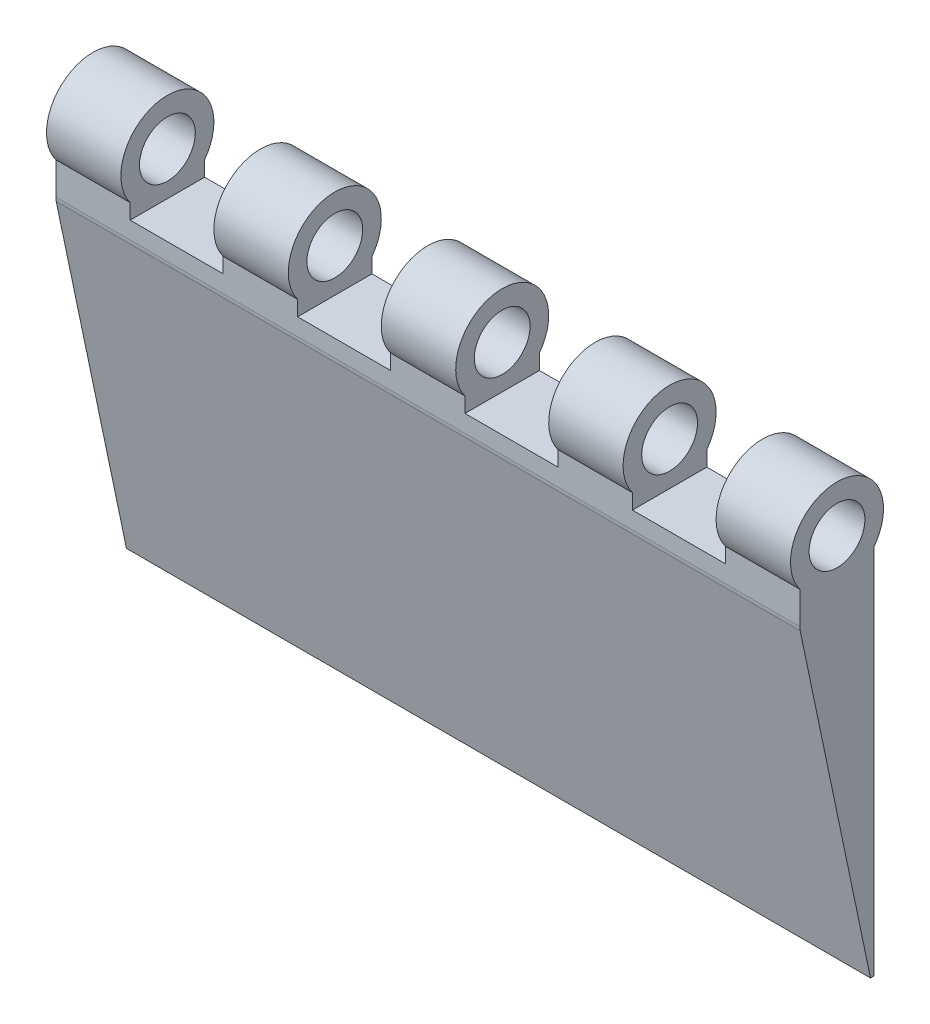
ISO-10303-21;
HEADER;
FILE_DESCRIPTION(('STEP AP214'),'2;1');
FILE_NAME('part.step','',(''),(''),'','','');
FILE_SCHEMA(('AUTOMOTIVE_DESIGN { 1 0 10303 214 1 1 1 1 }'));
ENDSEC;
DATA;
#1=APPLICATION_CONTEXT('core data for automotive mechanical design processes');
#2=APPLICATION_PROTOCOL_DEFINITION('international standard','automotive_design',2000,#1);
#3=PRODUCT_CONTEXT('',#1,'mechanical');
#4=PRODUCT('Part','Part','',(#3));
#5=PRODUCT_RELATED_PRODUCT_CATEGORY('part','',(#4));
#6=PRODUCT_DEFINITION_FORMATION('','',#4);
#7=PRODUCT_DEFINITION_CONTEXT('part definition',#1,'design');
#8=PRODUCT_DEFINITION('design','',#6,#7);
#9=PRODUCT_DEFINITION_SHAPE('','',#8);
#10=(LENGTH_UNIT() NAMED_UNIT(*) SI_UNIT(.MILLI.,.METRE.));
#11=(NAMED_UNIT(*) PLANE_ANGLE_UNIT() SI_UNIT($,.RADIAN.));
#12=(NAMED_UNIT(*) SI_UNIT($,.STERADIAN.) SOLID_ANGLE_UNIT());
#13=UNCERTAINTY_MEASURE_WITH_UNIT(LENGTH_MEASURE(1.E-05),#10,'distance_accuracy_value','');
#14=(GEOMETRIC_REPRESENTATION_CONTEXT(3) GLOBAL_UNCERTAINTY_ASSIGNED_CONTEXT((#13)) GLOBAL_UNIT_ASSIGNED_CONTEXT((#10,
#11,#12)) REPRESENTATION_CONTEXT('',''));
#15=CARTESIAN_POINT('',(0.,0.,0.));
#16=DIRECTION('',(0.,0.,1.));
#17=DIRECTION('',(1.,0.,0.));
#18=AXIS2_PLACEMENT_3D('',#15,#16,#17);
#19=CARTESIAN_POINT('',(47.0710678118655,11.5,0.));
#20=DIRECTION('',(-1.,0.,0.));
#21=DIRECTION('',(0.,0.,1.));
#22=AXIS2_PLACEMENT_3D('',#19,#20,#21);
#23=CYLINDRICAL_SURFACE('',#22,2.5);
#24=CARTESIAN_POINT('',(36.,11.5,0.));
#25=DIRECTION('',(1.,0.,0.));
#26=DIRECTION('',(0.,1.,0.));
#27=AXIS2_PLACEMENT_3D('',#24,#25,#26);
#28=CIRCLE('',#27,2.5);
#29=CARTESIAN_POINT('',(36.,10.,2.));
#30=VERTEX_POINT('',#29);
#31=CARTESIAN_POINT('',(36.,10.,-2.));
#32=VERTEX_POINT('',#31);
#33=EDGE_CURVE('E295',#30,#32,#28,.F.);
#34=ORIENTED_EDGE('',*,*,#33,.F.);
#35=DIRECTION('',(-1.,0.,0.));
#36=VECTOR('',#35,1.);
#37=CARTESIAN_POINT('',(40.,10.,2.));
#38=LINE('',#37,#36);
#39=CARTESIAN_POINT('',(40.,10.,2.));
#40=VERTEX_POINT('',#39);
#41=EDGE_CURVE('E237',#40,#30,#38,.T.);
#42=ORIENTED_EDGE('',*,*,#41,.F.);
#43=CARTESIAN_POINT('',(40.,11.5,0.));
#44=DIRECTION('',(1.,0.,0.));
#45=DIRECTION('',(0.,0.,-1.));
#46=AXIS2_PLACEMENT_3D('',#43,#44,#45);
#47=CIRCLE('',#46,2.5);
#48=CARTESIAN_POINT('',(40.,10.,-2.));
#49=VERTEX_POINT('',#48);
#50=EDGE_CURVE('E359',#40,#49,#47,.F.);
#51=ORIENTED_EDGE('',*,*,#50,.T.);
#52=DIRECTION('',(-1.,0.,0.));
#53=VECTOR('',#52,1.);
#54=CARTESIAN_POINT('',(40.,10.,-2.));
#55=LINE('',#54,#53);
#56=EDGE_CURVE('E243',#49,#32,#55,.T.);
#57=ORIENTED_EDGE('',*,*,#56,.T.);
#58=EDGE_LOOP('',(#34,#42,#51,#57));
#59=FACE_BOUND('',#58,.T.);
#60=ADVANCED_FACE('F39',(#59),#23,.T.);
#61=CARTESIAN_POINT('',(22.,11.5,0.));
#62=DIRECTION('',(-1.,0.,0.));
#63=DIRECTION('',(0.,-1.,0.));
#64=AXIS2_PLACEMENT_3D('',#61,#62,#63);
#65=CIRCLE('',#64,2.5);
#66=CARTESIAN_POINT('',(22.,10.,-2.));
#67=VERTEX_POINT('',#66);
#68=CARTESIAN_POINT('',(22.,10.,2.));
#69=VERTEX_POINT('',#68);
#70=EDGE_CURVE('E283',#67,#69,#65,.F.);
#71=ORIENTED_EDGE('',*,*,#70,.F.);
#72=CARTESIAN_POINT('',(18.,10.,-2.));
#73=VERTEX_POINT('',#72);
#74=EDGE_CURVE('E320',#67,#73,#55,.T.);
#75=ORIENTED_EDGE('',*,*,#74,.T.);
#76=CARTESIAN_POINT('',(18.,11.5,0.));
#77=DIRECTION('',(1.,0.,0.));
#78=DIRECTION('',(0.,1.,0.));
#79=AXIS2_PLACEMENT_3D('',#76,#77,#78);
#80=CIRCLE('',#79,2.5);
#81=CARTESIAN_POINT('',(18.,10.,2.));
#82=VERTEX_POINT('',#81);
#83=EDGE_CURVE('E265',#82,#73,#80,.F.);
#84=ORIENTED_EDGE('',*,*,#83,.F.);
#85=EDGE_CURVE('E329',#69,#82,#38,.T.);
#86=ORIENTED_EDGE('',*,*,#85,.F.);
#87=EDGE_LOOP('',(#71,#75,#84,#86));
#88=FACE_BOUND('',#87,.T.);
#89=ADVANCED_FACE('F388',(#88),#23,.T.);
#90=CARTESIAN_POINT('',(13.,11.5,0.));
#91=DIRECTION('',(-1.,0.,0.));
#92=DIRECTION('',(0.,-1.,0.));
#93=AXIS2_PLACEMENT_3D('',#90,#91,#92);
#94=CIRCLE('',#93,2.5);
#95=CARTESIAN_POINT('',(13.,10.,-2.));
#96=VERTEX_POINT('',#95);
#97=CARTESIAN_POINT('',(13.,10.,2.));
#98=VERTEX_POINT('',#97);
#99=EDGE_CURVE('E271',#96,#98,#94,.F.);
#100=ORIENTED_EDGE('',*,*,#99,.F.);
#101=CARTESIAN_POINT('',(9.,10.,-2.));
#102=VERTEX_POINT('',#101);
#103=EDGE_CURVE('E323',#96,#102,#55,.T.);
#104=ORIENTED_EDGE('',*,*,#103,.T.);
#105=CARTESIAN_POINT('',(9.,11.5,0.));
#106=DIRECTION('',(1.,0.,0.));
#107=DIRECTION('',(0.,1.,0.));
#108=AXIS2_PLACEMENT_3D('',#105,#106,#107);
#109=CIRCLE('',#108,2.5);
#110=CARTESIAN_POINT('',(9.,10.,2.));
#111=VERTEX_POINT('',#110);
#112=EDGE_CURVE('E253',#111,#102,#109,.F.);
#113=ORIENTED_EDGE('',*,*,#112,.F.);
#114=EDGE_CURVE('E332',#98,#111,#38,.T.);
#115=ORIENTED_EDGE('',*,*,#114,.F.);
#116=EDGE_LOOP('',(#100,#104,#113,#115));
#117=FACE_BOUND('',#116,.T.);
#118=ADVANCED_FACE('F393',(#117),#23,.T.);
#119=CARTESIAN_POINT('',(4.,11.5,0.));
#120=DIRECTION('',(-1.,0.,0.));
#121=DIRECTION('',(0.,-1.,0.));
#122=AXIS2_PLACEMENT_3D('',#119,#120,#121);
#123=CIRCLE('',#122,2.5);
#124=CARTESIAN_POINT('',(4.,10.,-2.));
#125=VERTEX_POINT('',#124);
#126=CARTESIAN_POINT('',(4.,10.,2.));
#127=VERTEX_POINT('',#126);
#128=EDGE_CURVE('E259',#125,#127,#123,.F.);
#129=ORIENTED_EDGE('',*,*,#128,.F.);
#130=CARTESIAN_POINT('',(0.,10.,-2.));
#131=VERTEX_POINT('',#130);
#132=EDGE_CURVE('E241',#125,#131,#55,.T.);
#133=ORIENTED_EDGE('',*,*,#132,.T.);
#134=CARTESIAN_POINT('',(0.,11.5,0.));
#135=DIRECTION('',(-1.,0.,0.));
#136=DIRECTION('',(0.,0.,1.));
#137=AXIS2_PLACEMENT_3D('',#134,#135,#136);
#138=CIRCLE('',#137,2.5);
#139=CARTESIAN_POINT('',(0.,10.,2.));
#140=VERTEX_POINT('',#139);
#141=EDGE_CURVE('E343',#140,#131,#138,.T.);
#142=ORIENTED_EDGE('',*,*,#141,.F.);
#143=EDGE_CURVE('E220',#127,#140,#38,.T.);
#144=ORIENTED_EDGE('',*,*,#143,.F.);
#145=EDGE_LOOP('',(#129,#133,#142,#144));
#146=FACE_BOUND('',#145,.T.);
#147=ADVANCED_FACE('F344',(#146),#23,.T.);
#148=CARTESIAN_POINT('',(47.0710678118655,11.5,0.));
#149=DIRECTION('',(-1.,0.,0.));
#150=DIRECTION('',(0.,0.,1.));
#151=AXIS2_PLACEMENT_3D('',#148,#149,#150);
#152=CYLINDRICAL_SURFACE('',#151,1.5);
#153=CARTESIAN_POINT('',(36.,11.5,0.));
#154=DIRECTION('',(1.,0.,0.));
#155=DIRECTION('',(0.,1.,0.));
#156=AXIS2_PLACEMENT_3D('',#153,#154,#155);
#157=CIRCLE('',#156,1.5);
#158=CARTESIAN_POINT('',(36.,13.,0.));
#159=VERTEX_POINT('',#158);
#160=EDGE_CURVE('E291',#159,#159,#157,.F.);
#161=ORIENTED_EDGE('',*,*,#160,.T.);
#162=EDGE_LOOP('',(#161));
#163=FACE_BOUND('',#162,.T.);
#164=CARTESIAN_POINT('',(40.,11.5,0.));
#165=DIRECTION('',(1.,0.,0.));
#166=DIRECTION('',(0.,0.,-1.));
#167=AXIS2_PLACEMENT_3D('',#164,#165,#166);
#168=CIRCLE('',#167,1.5);
#169=CARTESIAN_POINT('',(40.,11.5,-1.5));
#170=VERTEX_POINT('',#169);
#171=EDGE_CURVE('E231',#170,#170,#168,.F.);
#172=ORIENTED_EDGE('',*,*,#171,.F.);
#173=EDGE_LOOP('',(#172));
#174=FACE_BOUND('',#173,.T.);
#175=ADVANCED_FACE('F408',(#163,#174),#152,.F.);
#176=CARTESIAN_POINT('',(4.,11.5,0.));
#177=DIRECTION('',(-1.,0.,0.));
#178=DIRECTION('',(0.,-1.,0.));
#179=AXIS2_PLACEMENT_3D('',#176,#177,#178);
#180=CIRCLE('',#179,1.5);
#181=CARTESIAN_POINT('',(4.,10.,0.));
#182=VERTEX_POINT('',#181);
#183=EDGE_CURVE('E255',#182,#182,#180,.F.);
#184=ORIENTED_EDGE('',*,*,#183,.T.);
#185=EDGE_LOOP('',(#184));
#186=FACE_BOUND('',#185,.T.);
#187=CARTESIAN_POINT('',(0.,11.5,0.));
#188=DIRECTION('',(-1.,0.,0.));
#189=DIRECTION('',(0.,0.,1.));
#190=AXIS2_PLACEMENT_3D('',#187,#188,#189);
#191=CIRCLE('',#190,1.5);
#192=CARTESIAN_POINT('',(0.,11.5,1.5));
#193=VERTEX_POINT('',#192);
#194=EDGE_CURVE('E348',#193,#193,#191,.T.);
#195=ORIENTED_EDGE('',*,*,#194,.T.);
#196=EDGE_LOOP('',(#195));
#197=FACE_BOUND('',#196,.T.);
#198=ADVANCED_FACE('F413',(#186,#197),#152,.F.);
#199=CARTESIAN_POINT('',(40.,10.,-2.));
#200=DIRECTION('',(0.,0.,1.));
#201=DIRECTION('',(0.,-1.,0.));
#202=AXIS2_PLACEMENT_3D('',#199,#200,#201);
#203=PLANE('',#202);
#204=DIRECTION('',(1.,0.,0.));
#205=VECTOR('',#204,1.);
#206=CARTESIAN_POINT('',(40.,9.18500534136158,-2.));
#207=LINE('',#206,#205);
#208=CARTESIAN_POINT('',(31.,9.18500534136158,-2.));
#209=VERTEX_POINT('',#208);
#210=CARTESIAN_POINT('',(36.,9.18500534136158,-2.));
#211=VERTEX_POINT('',#210);
#212=EDGE_CURVE('E362',#209,#211,#207,.T.);
#213=ORIENTED_EDGE('',*,*,#212,.T.);
#214=DIRECTION('',(0.,1.,0.));
#215=VECTOR('',#214,1.);
#216=CARTESIAN_POINT('',(36.,10.,-2.));
#217=LINE('',#216,#215);
#218=EDGE_CURVE('E375',#211,#32,#217,.T.);
#219=ORIENTED_EDGE('',*,*,#218,.T.);
#220=ORIENTED_EDGE('',*,*,#56,.F.);
#221=DIRECTION('',(0.,1.,0.));
#222=VECTOR('',#221,1.);
#223=CARTESIAN_POINT('',(40.,10.,-2.));
#224=LINE('',#223,#222);
#225=CARTESIAN_POINT('',(40.,-10.,-2.));
#226=VERTEX_POINT('',#225);
#227=EDGE_CURVE('E222',#226,#49,#224,.T.);
#228=ORIENTED_EDGE('',*,*,#227,.F.);
#229=DIRECTION('',(-1.,0.,0.));
#230=VECTOR('',#229,1.);
#231=CARTESIAN_POINT('',(40.,-10.,-2.));
#232=LINE('',#231,#230);
#233=CARTESIAN_POINT('',(0.,-10.,-2.));
#234=VERTEX_POINT('',#233);
#235=EDGE_CURVE('E213',#226,#234,#232,.T.);
#236=ORIENTED_EDGE('',*,*,#235,.T.);
#237=DIRECTION('',(0.,1.,0.));
#238=VECTOR('',#237,1.);
#239=CARTESIAN_POINT('',(0.,10.,-2.));
#240=LINE('',#239,#238);
#241=EDGE_CURVE('E226',#234,#131,#240,.T.);
#242=ORIENTED_EDGE('',*,*,#241,.T.);
#243=ORIENTED_EDGE('',*,*,#132,.F.);
#244=DIRECTION('',(0.,-1.,0.));
#245=VECTOR('',#244,1.);
#246=CARTESIAN_POINT('',(4.,10.,-2.));
#247=LINE('',#246,#245);
#248=CARTESIAN_POINT('',(4.,9.18500534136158,-2.));
#249=VERTEX_POINT('',#248);
#250=EDGE_CURVE('E266',#125,#249,#247,.T.);
#251=ORIENTED_EDGE('',*,*,#250,.T.);
#252=DIRECTION('',(1.,0.,0.));
#253=VECTOR('',#252,1.);
#254=CARTESIAN_POINT('',(40.,9.18500534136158,-2.));
#255=LINE('',#254,#253);
#256=CARTESIAN_POINT('',(9.,9.18500534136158,-2.));
#257=VERTEX_POINT('',#256);
#258=EDGE_CURVE('E432',#249,#257,#255,.T.);
#259=ORIENTED_EDGE('',*,*,#258,.T.);
#260=DIRECTION('',(0.,1.,0.));
#261=VECTOR('',#260,1.);
#262=CARTESIAN_POINT('',(9.,10.,-2.));
#263=LINE('',#262,#261);
#264=EDGE_CURVE('E260',#257,#102,#263,.T.);
#265=ORIENTED_EDGE('',*,*,#264,.T.);
#266=ORIENTED_EDGE('',*,*,#103,.F.);
#267=DIRECTION('',(0.,-1.,0.));
#268=VECTOR('',#267,1.);
#269=CARTESIAN_POINT('',(13.,10.,-2.));
#270=LINE('',#269,#268);
#271=CARTESIAN_POINT('',(13.,9.18500534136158,-2.));
#272=VERTEX_POINT('',#271);
#273=EDGE_CURVE('E278',#96,#272,#270,.T.);
#274=ORIENTED_EDGE('',*,*,#273,.T.);
#275=DIRECTION('',(1.,0.,0.));
#276=VECTOR('',#275,1.);
#277=CARTESIAN_POINT('',(40.,9.18500534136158,-2.));
#278=LINE('',#277,#276);
#279=CARTESIAN_POINT('',(18.,9.18500534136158,-2.));
#280=VERTEX_POINT('',#279);
#281=EDGE_CURVE('E498',#272,#280,#278,.T.);
#282=ORIENTED_EDGE('',*,*,#281,.T.);
#283=DIRECTION('',(0.,1.,0.));
#284=VECTOR('',#283,1.);
#285=CARTESIAN_POINT('',(18.,10.,-2.));
#286=LINE('',#285,#284);
#287=EDGE_CURVE('E272',#280,#73,#286,.T.);
#288=ORIENTED_EDGE('',*,*,#287,.T.);
#289=ORIENTED_EDGE('',*,*,#74,.F.);
#290=DIRECTION('',(0.,-1.,0.));
#291=VECTOR('',#290,1.);
#292=CARTESIAN_POINT('',(22.,10.,-2.));
#293=LINE('',#292,#291);
#294=CARTESIAN_POINT('',(22.,9.18500534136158,-2.));
#295=VERTEX_POINT('',#294);
#296=EDGE_CURVE('E290',#67,#295,#293,.T.);
#297=ORIENTED_EDGE('',*,*,#296,.T.);
#298=DIRECTION('',(1.,0.,0.));
#299=VECTOR('',#298,1.);
#300=CARTESIAN_POINT('',(40.,9.18500534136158,-2.));
#301=LINE('',#300,#299);
#302=CARTESIAN_POINT('',(27.,9.18500534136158,-2.));
#303=VERTEX_POINT('',#302);
#304=EDGE_CURVE('E501',#295,#303,#301,.T.);
#305=ORIENTED_EDGE('',*,*,#304,.T.);
#306=DIRECTION('',(0.,1.,0.));
#307=VECTOR('',#306,1.);
#308=CARTESIAN_POINT('',(27.,10.,-2.));
#309=LINE('',#308,#307);
#310=CARTESIAN_POINT('',(27.,10.,-2.));
#311=VERTEX_POINT('',#310);
#312=EDGE_CURVE('E284',#303,#311,#309,.T.);
#313=ORIENTED_EDGE('',*,*,#312,.T.);
#314=CARTESIAN_POINT('',(31.,10.,-2.));
#315=VERTEX_POINT('',#314);
#316=EDGE_CURVE('E248',#315,#311,#55,.T.);
#317=ORIENTED_EDGE('',*,*,#316,.F.);
#318=DIRECTION('',(0.,-1.,0.));
#319=VECTOR('',#318,1.);
#320=CARTESIAN_POINT('',(31.,10.,-2.));
#321=LINE('',#320,#319);
#322=EDGE_CURVE('E296',#315,#209,#321,.T.);
#323=ORIENTED_EDGE('',*,*,#322,.T.);
#324=EDGE_LOOP('',(#213,#219,#220,#228,#236,#242,#243,#251,#259,#265,#266,#274,#282,#288,#289,
#297,#305,#313,#317,#323));
#325=FACE_BOUND('',#324,.T.);
#326=ADVANCED_FACE('F374',(#325),#203,.F.);
#327=CARTESIAN_POINT('',(40.,10.,2.));
#328=DIRECTION('',(0.,0.,-1.));
#329=DIRECTION('',(0.,1.,0.));
#330=AXIS2_PLACEMENT_3D('',#327,#328,#329);
#331=PLANE('',#330);
#332=DIRECTION('',(0.,-1.,0.));
#333=VECTOR('',#332,1.);
#334=CARTESIAN_POINT('',(0.,10.,2.));
#335=LINE('',#334,#333);
#336=CARTESIAN_POINT('',(0.,8.2567908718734,2.));
#337=VERTEX_POINT('',#336);
#338=EDGE_CURVE('E230',#140,#337,#335,.T.);
#339=ORIENTED_EDGE('',*,*,#338,.T.);
#340=DIRECTION('',(-1.,0.,0.));
#341=VECTOR('',#340,1.);
#342=CARTESIAN_POINT('',(40.,8.2567908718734,2.));
#343=LINE('',#342,#341);
#344=CARTESIAN_POINT('',(40.,8.2567908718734,2.));
#345=VERTEX_POINT('',#344);
#346=EDGE_CURVE('E48',#337,#345,#343,.F.);
#347=ORIENTED_EDGE('',*,*,#346,.T.);
#348=DIRECTION('',(0.,-1.,0.));
#349=VECTOR('',#348,1.);
#350=CARTESIAN_POINT('',(40.,10.,2.));
#351=LINE('',#350,#349);
#352=EDGE_CURVE('E216',#40,#345,#351,.T.);
#353=ORIENTED_EDGE('',*,*,#352,.F.);
#354=ORIENTED_EDGE('',*,*,#41,.T.);
#355=DIRECTION('',(0.,-1.,0.));
#356=VECTOR('',#355,1.);
#357=CARTESIAN_POINT('',(36.,10.,2.));
#358=LINE('',#357,#356);
#359=CARTESIAN_POINT('',(36.,9.18500534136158,2.));
#360=VERTEX_POINT('',#359);
#361=EDGE_CURVE('E379',#30,#360,#358,.T.);
#362=ORIENTED_EDGE('',*,*,#361,.T.);
#363=DIRECTION('',(-1.,0.,0.));
#364=VECTOR('',#363,1.);
#365=CARTESIAN_POINT('',(40.,9.18500534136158,2.));
#366=LINE('',#365,#364);
#367=CARTESIAN_POINT('',(31.,9.18500534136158,2.));
#368=VERTEX_POINT('',#367);
#369=EDGE_CURVE('E308',#360,#368,#366,.T.);
#370=ORIENTED_EDGE('',*,*,#369,.T.);
#371=DIRECTION('',(0.,1.,0.));
#372=VECTOR('',#371,1.);
#373=CARTESIAN_POINT('',(31.,10.,2.));
#374=LINE('',#373,#372);
#375=CARTESIAN_POINT('',(31.,10.,2.));
#376=VERTEX_POINT('',#375);
#377=EDGE_CURVE('E483',#368,#376,#374,.T.);
#378=ORIENTED_EDGE('',*,*,#377,.T.);
#379=CARTESIAN_POINT('',(27.,10.,2.));
#380=VERTEX_POINT('',#379);
#381=EDGE_CURVE('E242',#376,#380,#38,.T.);
#382=ORIENTED_EDGE('',*,*,#381,.T.);
#383=DIRECTION('',(0.,-1.,0.));
#384=VECTOR('',#383,1.);
#385=CARTESIAN_POINT('',(27.,10.,2.));
#386=LINE('',#385,#384);
#387=CARTESIAN_POINT('',(27.,9.18500534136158,2.));
#388=VERTEX_POINT('',#387);
#389=EDGE_CURVE('E465',#380,#388,#386,.T.);
#390=ORIENTED_EDGE('',*,*,#389,.T.);
#391=DIRECTION('',(-1.,0.,0.));
#392=VECTOR('',#391,1.);
#393=CARTESIAN_POINT('',(40.,9.18500534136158,2.));
#394=LINE('',#393,#392);
#395=CARTESIAN_POINT('',(22.,9.18500534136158,2.));
#396=VERTEX_POINT('',#395);
#397=EDGE_CURVE('E304',#388,#396,#394,.T.);
#398=ORIENTED_EDGE('',*,*,#397,.T.);
#399=DIRECTION('',(0.,1.,0.));
#400=VECTOR('',#399,1.);
#401=CARTESIAN_POINT('',(22.,10.,2.));
#402=LINE('',#401,#400);
#403=EDGE_CURVE('E474',#396,#69,#402,.T.);
#404=ORIENTED_EDGE('',*,*,#403,.T.);
#405=ORIENTED_EDGE('',*,*,#85,.T.);
#406=DIRECTION('',(0.,-1.,0.));
#407=VECTOR('',#406,1.);
#408=CARTESIAN_POINT('',(18.,10.,2.));
#409=LINE('',#408,#407);
#410=CARTESIAN_POINT('',(18.,9.18500534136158,2.));
#411=VERTEX_POINT('',#410);
#412=EDGE_CURVE('E452',#82,#411,#409,.T.);
#413=ORIENTED_EDGE('',*,*,#412,.T.);
#414=DIRECTION('',(-1.,0.,0.));
#415=VECTOR('',#414,1.);
#416=CARTESIAN_POINT('',(40.,9.18500534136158,2.));
#417=LINE('',#416,#415);
#418=CARTESIAN_POINT('',(13.,9.18500534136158,2.));
#419=VERTEX_POINT('',#418);
#420=EDGE_CURVE('E300',#411,#419,#417,.T.);
#421=ORIENTED_EDGE('',*,*,#420,.T.);
#422=DIRECTION('',(0.,1.,0.));
#423=VECTOR('',#422,1.);
#424=CARTESIAN_POINT('',(13.,10.,2.));
#425=LINE('',#424,#423);
#426=EDGE_CURVE('E425',#419,#98,#425,.T.);
#427=ORIENTED_EDGE('',*,*,#426,.T.);
#428=ORIENTED_EDGE('',*,*,#114,.T.);
#429=DIRECTION('',(0.,-1.,0.));
#430=VECTOR('',#429,1.);
#431=CARTESIAN_POINT('',(9.,10.,2.));
#432=LINE('',#431,#430);
#433=CARTESIAN_POINT('',(9.,9.18500534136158,2.));
#434=VERTEX_POINT('',#433);
#435=EDGE_CURVE('E437',#111,#434,#432,.T.);
#436=ORIENTED_EDGE('',*,*,#435,.T.);
#437=DIRECTION('',(-1.,0.,0.));
#438=VECTOR('',#437,1.);
#439=CARTESIAN_POINT('',(40.,9.18500534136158,2.));
#440=LINE('',#439,#438);
#441=CARTESIAN_POINT('',(4.,9.18500534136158,2.));
#442=VERTEX_POINT('',#441);
#443=EDGE_CURVE('E247',#434,#442,#440,.T.);
#444=ORIENTED_EDGE('',*,*,#443,.T.);
#445=DIRECTION('',(0.,1.,0.));
#446=VECTOR('',#445,1.);
#447=CARTESIAN_POINT('',(4.,10.,2.));
#448=LINE('',#447,#446);
#449=EDGE_CURVE('E339',#442,#127,#448,.T.);
#450=ORIENTED_EDGE('',*,*,#449,.T.);
#451=ORIENTED_EDGE('',*,*,#143,.T.);
#452=EDGE_LOOP('',(#339,#347,#353,#354,#362,#370,#378,#382,#390,#398,#404,#405,#413,#421,#427,
#428,#436,#444,#450,#451));
#453=FACE_BOUND('',#452,.T.);
#454=ADVANCED_FACE('F338',(#453),#331,.F.);
#455=CARTESIAN_POINT('',(40.,-10.,2.));
#456=DIRECTION('',(0.,1.,0.));
#457=DIRECTION('',(0.,0.,1.));
#458=AXIS2_PLACEMENT_3D('',#455,#456,#457);
#459=PLANE('',#458);
#460=DIRECTION('',(0.,0.,-1.));
#461=VECTOR('',#460,1.);
#462=CARTESIAN_POINT('',(40.,-10.,2.));
#463=LINE('',#462,#461);
#464=CARTESIAN_POINT('',(40.,-10.,-1.8));
#465=VERTEX_POINT('',#464);
#466=EDGE_CURVE('E194',#465,#226,#463,.T.);
#467=ORIENTED_EDGE('',*,*,#466,.F.);
#468=DIRECTION('',(-1.,0.,0.));
#469=VECTOR('',#468,1.);
#470=CARTESIAN_POINT('',(40.,-10.,-1.8));
#471=LINE('',#470,#469);
#472=CARTESIAN_POINT('',(0.,-10.,-1.8));
#473=VERTEX_POINT('',#472);
#474=EDGE_CURVE('E201',#465,#473,#471,.T.);
#475=ORIENTED_EDGE('',*,*,#474,.T.);
#476=DIRECTION('',(0.,0.,-1.));
#477=VECTOR('',#476,1.);
#478=CARTESIAN_POINT('',(0.,-10.,2.));
#479=LINE('',#478,#477);
#480=EDGE_CURVE('E234',#473,#234,#479,.T.);
#481=ORIENTED_EDGE('',*,*,#480,.T.);
#482=ORIENTED_EDGE('',*,*,#235,.F.);
#483=EDGE_LOOP('',(#467,#475,#481,#482));
#484=FACE_BOUND('',#483,.T.);
#485=ADVANCED_FACE('F211',(#484),#459,.F.);
#486=CARTESIAN_POINT('',(40.,0.,0.));
#487=DIRECTION('',(1.,0.,0.));
#488=DIRECTION('',(0.,0.,-1.));
#489=AXIS2_PLACEMENT_3D('',#486,#487,#488);
#490=PLANE('',#489);
#491=ORIENTED_EDGE('',*,*,#352,.T.);
#492=CARTESIAN_POINT('',(40.,8.2567908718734,1.));
#493=DIRECTION('',(1.,0.,0.));
#494=DIRECTION('',(0.,0.,-1.));
#495=AXIS2_PLACEMENT_3D('',#492,#493,#494);
#496=CIRCLE('',#495,1.);
#497=CARTESIAN_POINT('',(40.,8.05190277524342,1.97878540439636));
#498=VERTEX_POINT('',#497);
#499=EDGE_CURVE('E11',#345,#498,#496,.T.);
#500=ORIENTED_EDGE('',*,*,#499,.T.);
#501=DIRECTION('',(0.,-0.978785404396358,-0.204888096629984));
#502=VECTOR('',#501,1.);
#503=CARTESIAN_POINT('',(40.,8.15324851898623,2.));
#504=LINE('',#503,#502);
#505=EDGE_CURVE('E188',#498,#465,#504,.T.);
#506=ORIENTED_EDGE('',*,*,#505,.T.);
#507=ORIENTED_EDGE('',*,*,#466,.T.);
#508=ORIENTED_EDGE('',*,*,#227,.T.);
#509=ORIENTED_EDGE('',*,*,#50,.F.);
#510=EDGE_LOOP('',(#491,#500,#506,#507,#508,#509));
#511=FACE_BOUND('',#510,.T.);
#512=ORIENTED_EDGE('',*,*,#171,.T.);
#513=EDGE_LOOP('',(#512));
#514=FACE_BOUND('',#513,.T.);
#515=ADVANCED_FACE('F190',(#511,#514),#490,.T.);
#516=CARTESIAN_POINT('',(0.,0.,0.));
#517=DIRECTION('',(1.,0.,0.));
#518=DIRECTION('',(0.,0.,-1.));
#519=AXIS2_PLACEMENT_3D('',#516,#517,#518);
#520=PLANE('',#519);
#521=DIRECTION('',(0.,-0.978785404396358,-0.204888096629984));
#522=VECTOR('',#521,1.);
#523=CARTESIAN_POINT('',(0.,8.15324851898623,2.));
#524=LINE('',#523,#522);
#525=CARTESIAN_POINT('',(0.,8.05190277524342,1.97878540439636));
#526=VERTEX_POINT('',#525);
#527=EDGE_CURVE('E202',#526,#473,#524,.T.);
#528=ORIENTED_EDGE('',*,*,#527,.F.);
#529=CARTESIAN_POINT('',(0.,8.2567908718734,1.));
#530=DIRECTION('',(1.,0.,0.));
#531=DIRECTION('',(0.,0.,-1.));
#532=AXIS2_PLACEMENT_3D('',#529,#530,#531);
#533=CIRCLE('',#532,1.);
#534=EDGE_CURVE('E62',#526,#337,#533,.F.);
#535=ORIENTED_EDGE('',*,*,#534,.T.);
#536=ORIENTED_EDGE('',*,*,#338,.F.);
#537=ORIENTED_EDGE('',*,*,#141,.T.);
#538=ORIENTED_EDGE('',*,*,#241,.F.);
#539=ORIENTED_EDGE('',*,*,#480,.F.);
#540=EDGE_LOOP('',(#528,#535,#536,#537,#538,#539));
#541=FACE_BOUND('',#540,.T.);
#542=ORIENTED_EDGE('',*,*,#194,.F.);
#543=EDGE_LOOP('',(#542));
#544=FACE_BOUND('',#543,.T.);
#545=ADVANCED_FACE('F350',(#541,#544),#520,.F.);
#546=CARTESIAN_POINT('',(31.,11.5,0.));
#547=DIRECTION('',(-1.,0.,0.));
#548=DIRECTION('',(0.,-1.,0.));
#549=AXIS2_PLACEMENT_3D('',#546,#547,#548);
#550=CIRCLE('',#549,2.5);
#551=EDGE_CURVE('E289',#315,#376,#550,.F.);
#552=ORIENTED_EDGE('',*,*,#551,.F.);
#553=ORIENTED_EDGE('',*,*,#316,.T.);
#554=CARTESIAN_POINT('',(27.,11.5,0.));
#555=DIRECTION('',(1.,0.,0.));
#556=DIRECTION('',(0.,1.,0.));
#557=AXIS2_PLACEMENT_3D('',#554,#555,#556);
#558=CIRCLE('',#557,2.5);
#559=EDGE_CURVE('E277',#380,#311,#558,.F.);
#560=ORIENTED_EDGE('',*,*,#559,.F.);
#561=ORIENTED_EDGE('',*,*,#381,.F.);
#562=EDGE_LOOP('',(#552,#553,#560,#561));
#563=FACE_BOUND('',#562,.T.);
#564=ADVANCED_FACE('F353',(#563),#23,.T.);
#565=CARTESIAN_POINT('',(9.,9.18500534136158,2.5));
#566=DIRECTION('',(0.,-1.,0.));
#567=DIRECTION('',(0.,0.,-1.));
#568=AXIS2_PLACEMENT_3D('',#565,#566,#567);
#569=PLANE('',#568);
#570=DIRECTION('',(0.,0.,-1.));
#571=VECTOR('',#570,1.);
#572=CARTESIAN_POINT('',(4.,9.18500534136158,2.5));
#573=LINE('',#572,#571);
#574=EDGE_CURVE('E537',#442,#249,#573,.T.);
#575=ORIENTED_EDGE('',*,*,#574,.F.);
#576=ORIENTED_EDGE('',*,*,#443,.F.);
#577=DIRECTION('',(0.,0.,-1.));
#578=VECTOR('',#577,1.);
#579=CARTESIAN_POINT('',(9.,9.18500534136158,2.5));
#580=LINE('',#579,#578);
#581=EDGE_CURVE('E209',#434,#257,#580,.T.);
#582=ORIENTED_EDGE('',*,*,#581,.T.);
#583=ORIENTED_EDGE('',*,*,#258,.F.);
#584=EDGE_LOOP('',(#575,#576,#582,#583));
#585=FACE_BOUND('',#584,.T.);
#586=ADVANCED_FACE('F398',(#585),#569,.F.);
#587=CARTESIAN_POINT('',(4.00000000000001,16.4084331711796,2.5));
#588=DIRECTION('',(-1.,0.,0.));
#589=DIRECTION('',(0.,-1.,0.));
#590=AXIS2_PLACEMENT_3D('',#587,#588,#589);
#591=PLANE('',#590);
#592=ORIENTED_EDGE('',*,*,#183,.F.);
#593=EDGE_LOOP('',(#592));
#594=FACE_BOUND('',#593,.T.);
#595=ORIENTED_EDGE('',*,*,#128,.T.);
#596=ORIENTED_EDGE('',*,*,#449,.F.);
#597=ORIENTED_EDGE('',*,*,#574,.T.);
#598=ORIENTED_EDGE('',*,*,#250,.F.);
#599=EDGE_LOOP('',(#595,#596,#597,#598));
#600=FACE_BOUND('',#599,.T.);
#601=ADVANCED_FACE('F403',(#594,#600),#591,.F.);
#602=CARTESIAN_POINT('',(9.00000000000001,16.4084331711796,2.5));
#603=DIRECTION('',(1.,0.,0.));
#604=DIRECTION('',(0.,1.,0.));
#605=AXIS2_PLACEMENT_3D('',#602,#603,#604);
#606=PLANE('',#605);
#607=CARTESIAN_POINT('',(9.,11.5,0.));
#608=DIRECTION('',(1.,0.,0.));
#609=DIRECTION('',(0.,1.,0.));
#610=AXIS2_PLACEMENT_3D('',#607,#608,#609);
#611=CIRCLE('',#610,1.5);
#612=CARTESIAN_POINT('',(9.,13.,0.));
#613=VERTEX_POINT('',#612);
#614=EDGE_CURVE('E249',#613,#613,#611,.F.);
#615=ORIENTED_EDGE('',*,*,#614,.F.);
#616=EDGE_LOOP('',(#615));
#617=FACE_BOUND('',#616,.T.);
#618=ORIENTED_EDGE('',*,*,#581,.F.);
#619=ORIENTED_EDGE('',*,*,#435,.F.);
#620=ORIENTED_EDGE('',*,*,#112,.T.);
#621=ORIENTED_EDGE('',*,*,#264,.F.);
#622=EDGE_LOOP('',(#618,#619,#620,#621));
#623=FACE_BOUND('',#622,.T.);
#624=ADVANCED_FACE('F544',(#617,#623),#606,.F.);
#625=CARTESIAN_POINT('',(18.,9.18500534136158,2.5));
#626=DIRECTION('',(0.,-1.,0.));
#627=DIRECTION('',(0.,0.,-1.));
#628=AXIS2_PLACEMENT_3D('',#625,#626,#627);
#629=PLANE('',#628);
#630=DIRECTION('',(0.,0.,-1.));
#631=VECTOR('',#630,1.);
#632=CARTESIAN_POINT('',(13.,9.18500534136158,2.5));
#633=LINE('',#632,#631);
#634=EDGE_CURVE('E529',#419,#272,#633,.T.);
#635=ORIENTED_EDGE('',*,*,#634,.F.);
#636=ORIENTED_EDGE('',*,*,#420,.F.);
#637=DIRECTION('',(0.,0.,-1.));
#638=VECTOR('',#637,1.);
#639=CARTESIAN_POINT('',(18.,9.18500534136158,2.5));
#640=LINE('',#639,#638);
#641=EDGE_CURVE('E533',#411,#280,#640,.T.);
#642=ORIENTED_EDGE('',*,*,#641,.T.);
#643=ORIENTED_EDGE('',*,*,#281,.F.);
#644=EDGE_LOOP('',(#635,#636,#642,#643));
#645=FACE_BOUND('',#644,.T.);
#646=ADVANCED_FACE('F548',(#645),#629,.F.);
#647=CARTESIAN_POINT('',(13.,16.4084331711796,2.5));
#648=DIRECTION('',(-1.,0.,0.));
#649=DIRECTION('',(0.,-1.,0.));
#650=AXIS2_PLACEMENT_3D('',#647,#648,#649);
#651=PLANE('',#650);
#652=CARTESIAN_POINT('',(13.,11.5,0.));
#653=DIRECTION('',(-1.,0.,0.));
#654=DIRECTION('',(0.,-1.,0.));
#655=AXIS2_PLACEMENT_3D('',#652,#653,#654);
#656=CIRCLE('',#655,1.5);
#657=CARTESIAN_POINT('',(13.,10.,0.));
#658=VERTEX_POINT('',#657);
#659=EDGE_CURVE('E267',#658,#658,#656,.F.);
#660=ORIENTED_EDGE('',*,*,#659,.F.);
#661=EDGE_LOOP('',(#660));
#662=FACE_BOUND('',#661,.T.);
#663=ORIENTED_EDGE('',*,*,#99,.T.);
#664=ORIENTED_EDGE('',*,*,#426,.F.);
#665=ORIENTED_EDGE('',*,*,#634,.T.);
#666=ORIENTED_EDGE('',*,*,#273,.F.);
#667=EDGE_LOOP('',(#663,#664,#665,#666));
#668=FACE_BOUND('',#667,.T.);
#669=ADVANCED_FACE('F546',(#662,#668),#651,.F.);
#670=CARTESIAN_POINT('',(18.,16.4084331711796,2.5));
#671=DIRECTION('',(1.,0.,0.));
#672=DIRECTION('',(0.,1.,0.));
#673=AXIS2_PLACEMENT_3D('',#670,#671,#672);
#674=PLANE('',#673);
#675=CARTESIAN_POINT('',(18.,11.5,0.));
#676=DIRECTION('',(1.,0.,0.));
#677=DIRECTION('',(0.,1.,0.));
#678=AXIS2_PLACEMENT_3D('',#675,#676,#677);
#679=CIRCLE('',#678,1.5);
#680=CARTESIAN_POINT('',(18.,13.,0.));
#681=VERTEX_POINT('',#680);
#682=EDGE_CURVE('E261',#681,#681,#679,.F.);
#683=ORIENTED_EDGE('',*,*,#682,.F.);
#684=EDGE_LOOP('',(#683));
#685=FACE_BOUND('',#684,.T.);
#686=ORIENTED_EDGE('',*,*,#641,.F.);
#687=ORIENTED_EDGE('',*,*,#412,.F.);
#688=ORIENTED_EDGE('',*,*,#83,.T.);
#689=ORIENTED_EDGE('',*,*,#287,.F.);
#690=EDGE_LOOP('',(#686,#687,#688,#689));
#691=FACE_BOUND('',#690,.T.);
#692=ADVANCED_FACE('F585',(#685,#691),#674,.F.);
#693=CARTESIAN_POINT('',(27.,9.18500534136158,2.5));
#694=DIRECTION('',(0.,-1.,0.));
#695=DIRECTION('',(0.,0.,-1.));
#696=AXIS2_PLACEMENT_3D('',#693,#694,#695);
#697=PLANE('',#696);
#698=DIRECTION('',(0.,0.,-1.));
#699=VECTOR('',#698,1.);
#700=CARTESIAN_POINT('',(22.,9.18500534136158,2.5));
#701=LINE('',#700,#699);
#702=EDGE_CURVE('E518',#396,#295,#701,.T.);
#703=ORIENTED_EDGE('',*,*,#702,.F.);
#704=ORIENTED_EDGE('',*,*,#397,.F.);
#705=DIRECTION('',(0.,0.,-1.));
#706=VECTOR('',#705,1.);
#707=CARTESIAN_POINT('',(27.,9.18500534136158,2.5));
#708=LINE('',#707,#706);
#709=EDGE_CURVE('E525',#388,#303,#708,.T.);
#710=ORIENTED_EDGE('',*,*,#709,.T.);
#711=ORIENTED_EDGE('',*,*,#304,.F.);
#712=EDGE_LOOP('',(#703,#704,#710,#711));
#713=FACE_BOUND('',#712,.T.);
#714=ADVANCED_FACE('F561',(#713),#697,.F.);
#715=CARTESIAN_POINT('',(22.,16.4084331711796,2.5));
#716=DIRECTION('',(-1.,0.,0.));
#717=DIRECTION('',(0.,-1.,0.));
#718=AXIS2_PLACEMENT_3D('',#715,#716,#717);
#719=PLANE('',#718);
#720=CARTESIAN_POINT('',(22.,11.5,0.));
#721=DIRECTION('',(-1.,0.,0.));
#722=DIRECTION('',(0.,-1.,0.));
#723=AXIS2_PLACEMENT_3D('',#720,#721,#722);
#724=CIRCLE('',#723,1.5);
#725=CARTESIAN_POINT('',(22.,10.,0.));
#726=VERTEX_POINT('',#725);
#727=EDGE_CURVE('E279',#726,#726,#724,.F.);
#728=ORIENTED_EDGE('',*,*,#727,.F.);
#729=EDGE_LOOP('',(#728));
#730=FACE_BOUND('',#729,.T.);
#731=ORIENTED_EDGE('',*,*,#70,.T.);
#732=ORIENTED_EDGE('',*,*,#403,.F.);
#733=ORIENTED_EDGE('',*,*,#702,.T.);
#734=ORIENTED_EDGE('',*,*,#296,.F.);
#735=EDGE_LOOP('',(#731,#732,#733,#734));
#736=FACE_BOUND('',#735,.T.);
#737=ADVANCED_FACE('F556',(#730,#736),#719,.F.);
#738=CARTESIAN_POINT('',(27.,16.4084331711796,2.5));
#739=DIRECTION('',(1.,0.,0.));
#740=DIRECTION('',(0.,1.,0.));
#741=AXIS2_PLACEMENT_3D('',#738,#739,#740);
#742=PLANE('',#741);
#743=CARTESIAN_POINT('',(27.,11.5,0.));
#744=DIRECTION('',(1.,0.,0.));
#745=DIRECTION('',(0.,1.,0.));
#746=AXIS2_PLACEMENT_3D('',#743,#744,#745);
#747=CIRCLE('',#746,1.5);
#748=CARTESIAN_POINT('',(27.,13.,0.));
#749=VERTEX_POINT('',#748);
#750=EDGE_CURVE('E273',#749,#749,#747,.F.);
#751=ORIENTED_EDGE('',*,*,#750,.F.);
#752=EDGE_LOOP('',(#751));
#753=FACE_BOUND('',#752,.T.);
#754=ORIENTED_EDGE('',*,*,#709,.F.);
#755=ORIENTED_EDGE('',*,*,#389,.F.);
#756=ORIENTED_EDGE('',*,*,#559,.T.);
#757=ORIENTED_EDGE('',*,*,#312,.F.);
#758=EDGE_LOOP('',(#754,#755,#756,#757));
#759=FACE_BOUND('',#758,.T.);
#760=ADVANCED_FACE('F563',(#753,#759),#742,.F.);
#761=CARTESIAN_POINT('',(36.,9.18500534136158,2.5));
#762=DIRECTION('',(0.,-1.,0.));
#763=DIRECTION('',(0.,0.,-1.));
#764=AXIS2_PLACEMENT_3D('',#761,#762,#763);
#765=PLANE('',#764);
#766=DIRECTION('',(0.,0.,-1.));
#767=VECTOR('',#766,1.);
#768=CARTESIAN_POINT('',(31.,9.18500534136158,2.5));
#769=LINE('',#768,#767);
#770=EDGE_CURVE('E254',#368,#209,#769,.T.);
#771=ORIENTED_EDGE('',*,*,#770,.F.);
#772=ORIENTED_EDGE('',*,*,#369,.F.);
#773=DIRECTION('',(0.,0.,-1.));
#774=VECTOR('',#773,1.);
#775=CARTESIAN_POINT('',(36.,9.18500534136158,2.5));
#776=LINE('',#775,#774);
#777=EDGE_CURVE('E512',#360,#211,#776,.T.);
#778=ORIENTED_EDGE('',*,*,#777,.T.);
#779=ORIENTED_EDGE('',*,*,#212,.F.);
#780=EDGE_LOOP('',(#771,#772,#778,#779));
#781=FACE_BOUND('',#780,.T.);
#782=ADVANCED_FACE('F510',(#781),#765,.F.);
#783=CARTESIAN_POINT('',(36.,16.4084331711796,2.5));
#784=DIRECTION('',(1.,0.,0.));
#785=DIRECTION('',(0.,1.,0.));
#786=AXIS2_PLACEMENT_3D('',#783,#784,#785);
#787=PLANE('',#786);
#788=ORIENTED_EDGE('',*,*,#160,.F.);
#789=EDGE_LOOP('',(#788));
#790=FACE_BOUND('',#789,.T.);
#791=ORIENTED_EDGE('',*,*,#777,.F.);
#792=ORIENTED_EDGE('',*,*,#361,.F.);
#793=ORIENTED_EDGE('',*,*,#33,.T.);
#794=ORIENTED_EDGE('',*,*,#218,.F.);
#795=EDGE_LOOP('',(#791,#792,#793,#794));
#796=FACE_BOUND('',#795,.T.);
#797=ADVANCED_FACE('F566',(#790,#796),#787,.F.);
#798=CARTESIAN_POINT('',(31.,16.4084331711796,2.5));
#799=DIRECTION('',(-1.,0.,0.));
#800=DIRECTION('',(0.,-1.,0.));
#801=AXIS2_PLACEMENT_3D('',#798,#799,#800);
#802=PLANE('',#801);
#803=CARTESIAN_POINT('',(31.,11.5,0.));
#804=DIRECTION('',(-1.,0.,0.));
#805=DIRECTION('',(0.,-1.,0.));
#806=AXIS2_PLACEMENT_3D('',#803,#804,#805);
#807=CIRCLE('',#806,1.5);
#808=CARTESIAN_POINT('',(31.,10.,0.));
#809=VERTEX_POINT('',#808);
#810=EDGE_CURVE('E285',#809,#809,#807,.F.);
#811=ORIENTED_EDGE('',*,*,#810,.F.);
#812=EDGE_LOOP('',(#811));
#813=FACE_BOUND('',#812,.T.);
#814=ORIENTED_EDGE('',*,*,#551,.T.);
#815=ORIENTED_EDGE('',*,*,#377,.F.);
#816=ORIENTED_EDGE('',*,*,#770,.T.);
#817=ORIENTED_EDGE('',*,*,#322,.F.);
#818=EDGE_LOOP('',(#814,#815,#816,#817));
#819=FACE_BOUND('',#818,.T.);
#820=ADVANCED_FACE('F514',(#813,#819),#802,.F.);
#821=ORIENTED_EDGE('',*,*,#659,.T.);
#822=EDGE_LOOP('',(#821));
#823=FACE_BOUND('',#822,.T.);
#824=ORIENTED_EDGE('',*,*,#614,.T.);
#825=EDGE_LOOP('',(#824));
#826=FACE_BOUND('',#825,.T.);
#827=ADVANCED_FACE('F574',(#823,#826),#152,.F.);
#828=ORIENTED_EDGE('',*,*,#727,.T.);
#829=EDGE_LOOP('',(#828));
#830=FACE_BOUND('',#829,.T.);
#831=ORIENTED_EDGE('',*,*,#682,.T.);
#832=EDGE_LOOP('',(#831));
#833=FACE_BOUND('',#832,.T.);
#834=ADVANCED_FACE('F415',(#830,#833),#152,.F.);
#835=ORIENTED_EDGE('',*,*,#810,.T.);
#836=EDGE_LOOP('',(#835));
#837=FACE_BOUND('',#836,.T.);
#838=ORIENTED_EDGE('',*,*,#750,.T.);
#839=EDGE_LOOP('',(#838));
#840=FACE_BOUND('',#839,.T.);
#841=ADVANCED_FACE('F385',(#837,#840),#152,.F.);
#842=CARTESIAN_POINT('',(40.,8.15324851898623,2.));
#843=DIRECTION('',(0.,0.204888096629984,-0.978785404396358));
#844=DIRECTION('',(0.,0.978785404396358,0.204888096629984));
#845=AXIS2_PLACEMENT_3D('',#842,#843,#844);
#846=PLANE('',#845);
#847=ORIENTED_EDGE('',*,*,#505,.F.);
#848=DIRECTION('',(-1.,0.,0.));
#849=VECTOR('',#848,1.);
#850=CARTESIAN_POINT('',(40.,8.05190277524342,1.97878540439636));
#851=LINE('',#850,#849);
#852=EDGE_CURVE('E312',#498,#526,#851,.T.);
#853=ORIENTED_EDGE('',*,*,#852,.T.);
#854=ORIENTED_EDGE('',*,*,#527,.T.);
#855=ORIENTED_EDGE('',*,*,#474,.F.);
#856=EDGE_LOOP('',(#847,#853,#854,#855));
#857=FACE_BOUND('',#856,.T.);
#858=ADVANCED_FACE('F205',(#857),#846,.F.);
#859=CARTESIAN_POINT('',(40.,8.2567908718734,1.));
#860=DIRECTION('',(-1.,0.,0.));
#861=DIRECTION('',(0.,0.,1.));
#862=AXIS2_PLACEMENT_3D('',#859,#860,#861);
#863=CYLINDRICAL_SURFACE('',#862,1.);
#864=ORIENTED_EDGE('',*,*,#499,.F.);
#865=ORIENTED_EDGE('',*,*,#346,.F.);
#866=ORIENTED_EDGE('',*,*,#534,.F.);
#867=ORIENTED_EDGE('',*,*,#852,.F.);
#868=EDGE_LOOP('',(#864,#865,#866,#867));
#869=FACE_BOUND('',#868,.T.);
#870=ADVANCED_FACE('F41',(#869),#863,.T.);
#871=CLOSED_SHELL('',(#60,#89,#118,#147,#175,#198,#326,#454,#485,#515,#545,#564,#586,#601,#624,
#646,#669,#692,#714,#737,#760,#782,#797,#820,#827,#834,#841,#858,#870));
#872=MANIFOLD_SOLID_BREP('B2',#871);
#873=ADVANCED_BREP_SHAPE_REPRESENTATION('',(#18,#872),#14);
#874=SHAPE_DEFINITION_REPRESENTATION(#9,#873);
ENDSEC;
END-ISO-10303-21;
